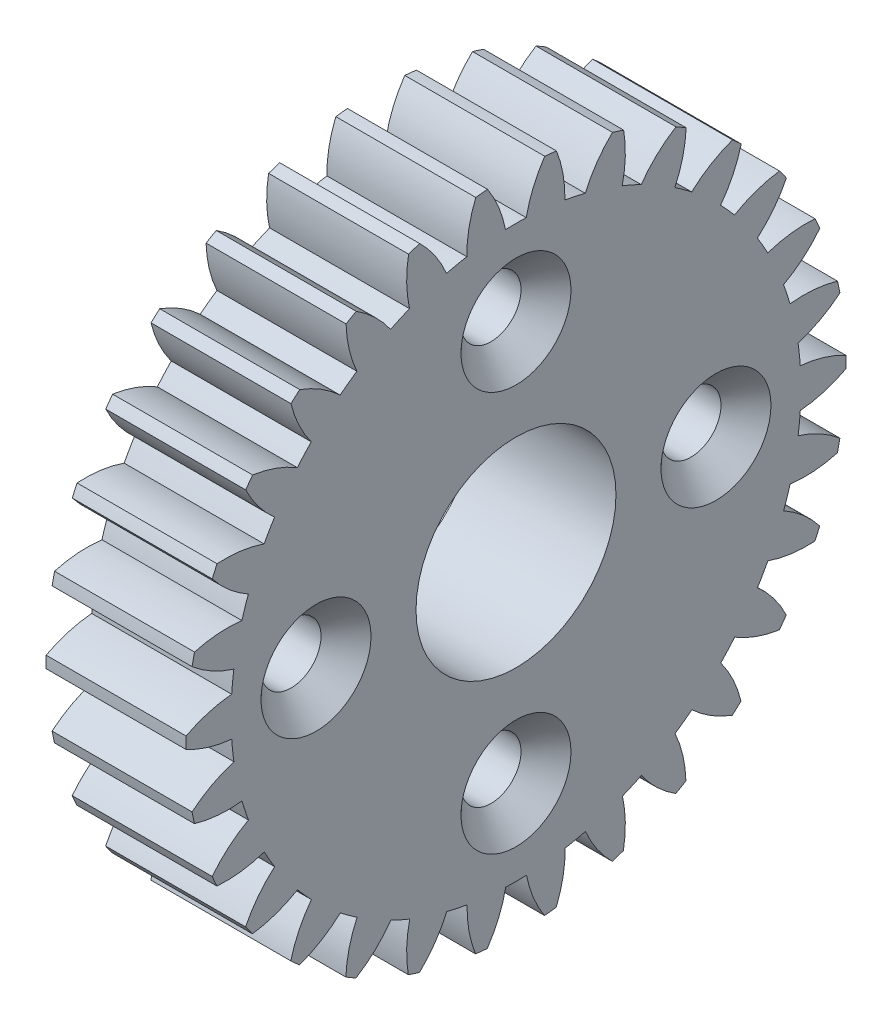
from build123d import *

# Parameters (mm, degrees)
BASPROSKE_W                                          = 7
BASPROSKE_H                                          = 16.5
TOOTHCUT_DEPTH                                       = 25.36185543
TEETHCUTS_COUNT                                      = 30
TEETHCUTS_ANGLE                                      = 348
BORSKE_R                                             = 5
BORE_DEPTH                                           = 51.0024384
CSK_FOR_M2_5_COUNTERSUNK_FLAT_HEAD_SCREW_D           = 2.9
CSK_FOR_M2_5_COUNTERSUNK_FLAT_HEAD_SCREW_CSINK_D     = 5.5
CSK_FOR_M2_5_COUNTERSUNK_FLAT_HEAD_SCREW_CSINK_ANGLE = 90
SKETCH17_R                                           = 1.5
CUT_EXTRUDE1_DEPTH                                   = 10


with BuildPart() as part:
    # BasProSke → Base-Revolve (revolve)
    with BuildSketch(Plane(origin=(0, 0, 0), x_dir=(1, 0, 0), z_dir=(0, 1, 0)), mode=Mode.PRIVATE) as base_revolve_sk:
        with Locations((3.5, 8.25)):
            Rectangle(BASPROSKE_W, BASPROSKE_H)
    revolve(base_revolve_sk.sketch.rotate(Axis((-10, 0, 0), (1, 0, 0)), 180), axis=Axis((-10, 0, 0), (1, 0, 0)))

    # TooCutSke → ToothCut (cut, through all)
    with BuildSketch(Plane(origin=(0, 0, 0), x_dir=(0, 0, -1), z_dir=(1, 0, 0))):
        with BuildLine():
            ThreePointArc((0.512941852, 14.239764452), (-0.006326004, 14.248998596), (-0.525585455, 14.239303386))
            ThreePointArc((-0.525585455, 14.239303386), (-0.866186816, 15.38381165), (-1.426691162, 16.438204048))
            ThreePointArc((-1.426691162, 16.438204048), (0.006104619, 16.499998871), (1.438854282, 16.437143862))
            ThreePointArc((1.438854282, 16.437143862), (0.86563981, 15.384913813), (0.512941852, 14.239764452))
        make_face()
    toothcut = extrude(amount=TOOTHCUT_DEPTH, mode=Mode.SUBTRACT)

    # TeethCuts: ToothCut ×30 about axis
    teethcuts_axis = Axis((-10, 0, 0), (1, 0, 0))
    for i in range(1, TEETHCUTS_COUNT):
        add(toothcut.rotate(teethcuts_axis, i * TEETHCUTS_ANGLE / (TEETHCUTS_COUNT - 1)), mode=Mode.SUBTRACT)

    # BorSke → Bore (cut, symmetric)
    with BuildSketch(Plane(origin=(0, 0, 0), x_dir=(0, 0, -1), z_dir=(1, 0, 0))):
        with Locations(Location((0, 0, 0), (0, 0, 180))):
            Circle(BORSKE_R)
    extrude(amount=BORE_DEPTH, both=True, mode=Mode.SUBTRACT)

    # CSK for M2.5 Countersunk Flat Head Screw (through all)
    with Locations(Plane(origin=(7, 0, 0), x_dir=(0, 0, -1), z_dir=(1, 0, 0))):
        with Locations((-10, 0), (0, -10), (10, 0), (0, 10)):
            CounterSinkHole(CSK_FOR_M2_5_COUNTERSUNK_FLAT_HEAD_SCREW_D / 2, CSK_FOR_M2_5_COUNTERSUNK_FLAT_HEAD_SCREW_CSINK_D / 2, counter_sink_angle=CSK_FOR_M2_5_COUNTERSUNK_FLAT_HEAD_SCREW_CSINK_ANGLE)

    # Sketch17 → Cut-Extrude1 (cut)
    with BuildSketch(Plane(origin=(7, 0, 0), x_dir=(0, 0, -1), z_dir=(1, 0, 0))):
        with Locations((0, 10)):
            Circle(SKETCH17_R)
        with Locations((-10, 0)):
            Circle(SKETCH17_R)
        with Locations((10, 0)):
            Circle(SKETCH17_R)
        with Locations((0, -10)):
            Circle(SKETCH17_R)
    extrude(amount=-CUT_EXTRUDE1_DEPTH, mode=Mode.SUBTRACT)


solid = part.part
